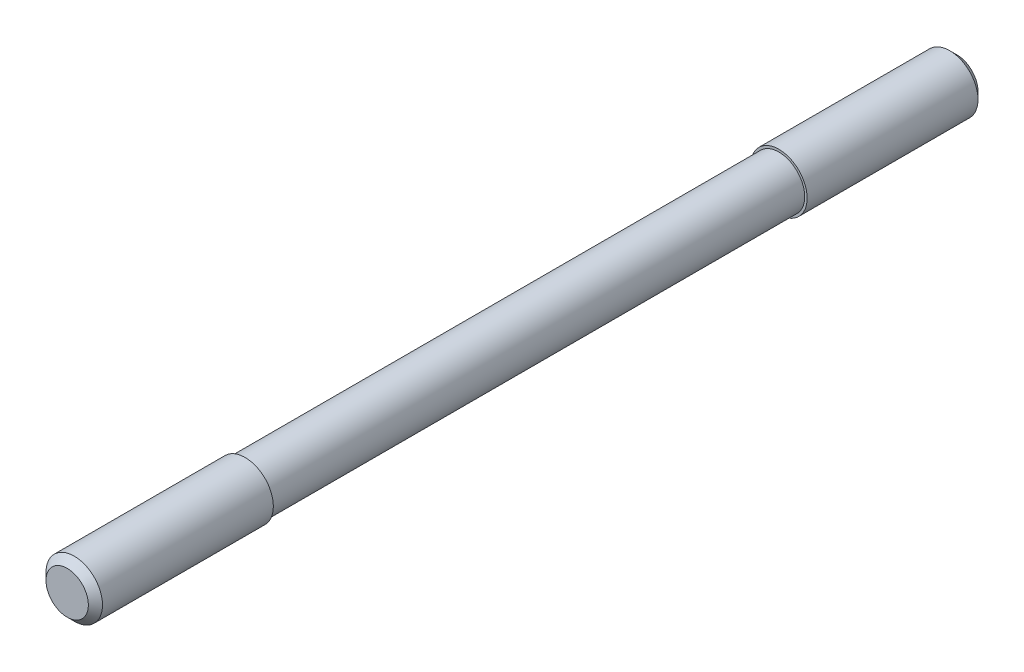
ISO-10303-21;
HEADER;
FILE_DESCRIPTION(('STEP AP214'),'2;1');
FILE_NAME('part.step','',(''),(''),'','','');
FILE_SCHEMA(('AUTOMOTIVE_DESIGN { 1 0 10303 214 1 1 1 1 }'));
ENDSEC;
DATA;
#1=APPLICATION_CONTEXT('core data for automotive mechanical design processes');
#2=APPLICATION_PROTOCOL_DEFINITION('international standard','automotive_design',2000,#1);
#3=PRODUCT_CONTEXT('',#1,'mechanical');
#4=PRODUCT('Part','Part','',(#3));
#5=PRODUCT_RELATED_PRODUCT_CATEGORY('part','',(#4));
#6=PRODUCT_DEFINITION_FORMATION('','',#4);
#7=PRODUCT_DEFINITION_CONTEXT('part definition',#1,'design');
#8=PRODUCT_DEFINITION('design','',#6,#7);
#9=PRODUCT_DEFINITION_SHAPE('','',#8);
#10=(LENGTH_UNIT() NAMED_UNIT(*) SI_UNIT(.MILLI.,.METRE.));
#11=(NAMED_UNIT(*) PLANE_ANGLE_UNIT() SI_UNIT($,.RADIAN.));
#12=(NAMED_UNIT(*) SI_UNIT($,.STERADIAN.) SOLID_ANGLE_UNIT());
#13=UNCERTAINTY_MEASURE_WITH_UNIT(LENGTH_MEASURE(1.E-05),#10,'distance_accuracy_value','');
#14=(GEOMETRIC_REPRESENTATION_CONTEXT(3) GLOBAL_UNCERTAINTY_ASSIGNED_CONTEXT((#13)) GLOBAL_UNIT_ASSIGNED_CONTEXT((#10,
#11,#12)) REPRESENTATION_CONTEXT('',''));
#15=CARTESIAN_POINT('',(0.,0.,0.));
#16=DIRECTION('',(0.,0.,1.));
#17=DIRECTION('',(1.,0.,0.));
#18=AXIS2_PLACEMENT_3D('',#15,#16,#17);
#19=CARTESIAN_POINT('',(0.,0.,0.));
#20=DIRECTION('',(0.,0.,1.));
#21=DIRECTION('',(1.,0.,0.));
#22=AXIS2_PLACEMENT_3D('',#19,#20,#21);
#23=PLANE('',#22);
#24=CARTESIAN_POINT('',(0.,0.,0.));
#25=DIRECTION('',(0.,0.,1.));
#26=DIRECTION('',(1.,0.,0.));
#27=AXIS2_PLACEMENT_3D('',#24,#25,#26);
#28=CIRCLE('',#27,7.5);
#29=CARTESIAN_POINT('',(7.5,0.,0.));
#30=VERTEX_POINT('',#29);
#31=EDGE_CURVE('E8',#30,#30,#28,.T.);
#32=ORIENTED_EDGE('',*,*,#31,.F.);
#33=EDGE_LOOP('',(#32));
#34=FACE_BOUND('',#33,.T.);
#35=ADVANCED_FACE('F12',(#34),#23,.F.);
#36=CARTESIAN_POINT('',(0.,0.,2.5));
#37=DIRECTION('',(0.,0.,1.));
#38=DIRECTION('',(1.,0.,0.));
#39=AXIS2_PLACEMENT_3D('',#36,#37,#38);
#40=CONICAL_SURFACE('',#39,10.,0.785398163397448);
#41=ORIENTED_EDGE('',*,*,#31,.T.);
#42=EDGE_LOOP('',(#41));
#43=FACE_BOUND('',#42,.T.);
#44=CARTESIAN_POINT('',(0.,0.,2.5));
#45=DIRECTION('',(0.,0.,1.));
#46=DIRECTION('',(1.,0.,0.));
#47=AXIS2_PLACEMENT_3D('',#44,#45,#46);
#48=CIRCLE('',#47,10.);
#49=CARTESIAN_POINT('',(10.,0.,2.5));
#50=VERTEX_POINT('',#49);
#51=EDGE_CURVE('E18',#50,#50,#48,.T.);
#52=ORIENTED_EDGE('',*,*,#51,.F.);
#53=EDGE_LOOP('',(#52));
#54=FACE_BOUND('',#53,.T.);
#55=ADVANCED_FACE('F61',(#43,#54),#40,.T.);
#56=CARTESIAN_POINT('',(0.,0.,70.));
#57=DIRECTION('',(0.,0.,1.));
#58=DIRECTION('',(1.,0.,0.));
#59=AXIS2_PLACEMENT_3D('',#56,#57,#58);
#60=CYLINDRICAL_SURFACE('',#59,10.);
#61=CARTESIAN_POINT('',(0.,0.,63.));
#62=DIRECTION('',(0.,0.,1.));
#63=DIRECTION('',(1.,0.,0.));
#64=AXIS2_PLACEMENT_3D('',#61,#62,#63);
#65=CIRCLE('',#64,10.);
#66=CARTESIAN_POINT('',(10.,0.,63.));
#67=VERTEX_POINT('',#66);
#68=EDGE_CURVE('E22',#67,#67,#65,.T.);
#69=ORIENTED_EDGE('',*,*,#68,.F.);
#70=EDGE_LOOP('',(#69));
#71=FACE_BOUND('',#70,.T.);
#72=ORIENTED_EDGE('',*,*,#51,.T.);
#73=EDGE_LOOP('',(#72));
#74=FACE_BOUND('',#73,.T.);
#75=ADVANCED_FACE('F66',(#71,#74),#60,.T.);
#76=CARTESIAN_POINT('',(10.,0.,63.));
#77=DIRECTION('',(0.,0.,-1.));
#78=DIRECTION('',(-1.,0.,0.));
#79=AXIS2_PLACEMENT_3D('',#76,#77,#78);
#80=PLANE('',#79);
#81=CARTESIAN_POINT('',(0.,0.,63.));
#82=DIRECTION('',(0.,0.,1.));
#83=DIRECTION('',(1.,0.,0.));
#84=AXIS2_PLACEMENT_3D('',#81,#82,#83);
#85=CIRCLE('',#84,9.15);
#86=CARTESIAN_POINT('',(9.15,0.,63.));
#87=VERTEX_POINT('',#86);
#88=EDGE_CURVE('E26',#87,#87,#85,.T.);
#89=ORIENTED_EDGE('',*,*,#88,.F.);
#90=EDGE_LOOP('',(#89));
#91=FACE_BOUND('',#90,.T.);
#92=ORIENTED_EDGE('',*,*,#68,.T.);
#93=EDGE_LOOP('',(#92));
#94=FACE_BOUND('',#93,.T.);
#95=ADVANCED_FACE('F70',(#91,#94),#80,.F.);
#96=CARTESIAN_POINT('',(0.,0.,70.));
#97=DIRECTION('',(0.,0.,1.));
#98=DIRECTION('',(1.,0.,0.));
#99=AXIS2_PLACEMENT_3D('',#96,#97,#98);
#100=CYLINDRICAL_SURFACE('',#99,9.15);
#101=CARTESIAN_POINT('',(0.,0.,252.));
#102=DIRECTION('',(0.,0.,1.));
#103=DIRECTION('',(1.,0.,0.));
#104=AXIS2_PLACEMENT_3D('',#101,#102,#103);
#105=CIRCLE('',#104,9.15);
#106=CARTESIAN_POINT('',(9.15,0.,252.));
#107=VERTEX_POINT('',#106);
#108=EDGE_CURVE('E31',#107,#107,#105,.T.);
#109=ORIENTED_EDGE('',*,*,#108,.F.);
#110=EDGE_LOOP('',(#109));
#111=FACE_BOUND('',#110,.T.);
#112=ORIENTED_EDGE('',*,*,#88,.T.);
#113=EDGE_LOOP('',(#112));
#114=FACE_BOUND('',#113,.T.);
#115=ADVANCED_FACE('F77',(#111,#114),#100,.T.);
#116=CARTESIAN_POINT('',(9.15,0.,252.));
#117=DIRECTION('',(0.,0.,1.));
#118=DIRECTION('',(1.,0.,0.));
#119=AXIS2_PLACEMENT_3D('',#116,#117,#118);
#120=PLANE('',#119);
#121=CARTESIAN_POINT('',(0.,0.,252.));
#122=DIRECTION('',(0.,0.,1.));
#123=DIRECTION('',(1.,0.,0.));
#124=AXIS2_PLACEMENT_3D('',#121,#122,#123);
#125=CIRCLE('',#124,10.);
#126=CARTESIAN_POINT('',(10.,0.,252.));
#127=VERTEX_POINT('',#126);
#128=EDGE_CURVE('E34',#127,#127,#125,.T.);
#129=ORIENTED_EDGE('',*,*,#128,.F.);
#130=EDGE_LOOP('',(#129));
#131=FACE_BOUND('',#130,.T.);
#132=ORIENTED_EDGE('',*,*,#108,.T.);
#133=EDGE_LOOP('',(#132));
#134=FACE_BOUND('',#133,.T.);
#135=ADVANCED_FACE('F57',(#131,#134),#120,.F.);
#136=CARTESIAN_POINT('',(0.,0.,70.));
#137=DIRECTION('',(0.,0.,1.));
#138=DIRECTION('',(1.,0.,0.));
#139=AXIS2_PLACEMENT_3D('',#136,#137,#138);
#140=CYLINDRICAL_SURFACE('',#139,10.);
#141=CARTESIAN_POINT('',(0.,0.,312.5));
#142=DIRECTION('',(0.,0.,1.));
#143=DIRECTION('',(1.,0.,0.));
#144=AXIS2_PLACEMENT_3D('',#141,#142,#143);
#145=CIRCLE('',#144,10.);
#146=CARTESIAN_POINT('',(10.,0.,312.5));
#147=VERTEX_POINT('',#146);
#148=EDGE_CURVE('E37',#147,#147,#145,.T.);
#149=ORIENTED_EDGE('',*,*,#148,.F.);
#150=EDGE_LOOP('',(#149));
#151=FACE_BOUND('',#150,.T.);
#152=ORIENTED_EDGE('',*,*,#128,.T.);
#153=EDGE_LOOP('',(#152));
#154=FACE_BOUND('',#153,.T.);
#155=ADVANCED_FACE('F48',(#151,#154),#140,.T.);
#156=CARTESIAN_POINT('',(0.,0.,315.));
#157=DIRECTION('',(0.,0.,-1.));
#158=DIRECTION('',(-1.,0.,0.));
#159=AXIS2_PLACEMENT_3D('',#156,#157,#158);
#160=CONICAL_SURFACE('',#159,7.5,0.785398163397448);
#161=ORIENTED_EDGE('',*,*,#148,.T.);
#162=EDGE_LOOP('',(#161));
#163=FACE_BOUND('',#162,.T.);
#164=CARTESIAN_POINT('',(0.,0.,315.));
#165=DIRECTION('',(0.,0.,1.));
#166=DIRECTION('',(1.,0.,0.));
#167=AXIS2_PLACEMENT_3D('',#164,#165,#166);
#168=CIRCLE('',#167,7.5);
#169=CARTESIAN_POINT('',(7.5,0.,315.));
#170=VERTEX_POINT('',#169);
#171=EDGE_CURVE('E40',#170,#170,#168,.T.);
#172=ORIENTED_EDGE('',*,*,#171,.F.);
#173=EDGE_LOOP('',(#172));
#174=FACE_BOUND('',#173,.T.);
#175=ADVANCED_FACE('F46',(#163,#174),#160,.T.);
#176=CARTESIAN_POINT('',(7.5,0.,315.));
#177=DIRECTION('',(0.,0.,-1.));
#178=DIRECTION('',(-1.,0.,0.));
#179=AXIS2_PLACEMENT_3D('',#176,#177,#178);
#180=PLANE('',#179);
#181=ORIENTED_EDGE('',*,*,#171,.T.);
#182=EDGE_LOOP('',(#181));
#183=FACE_BOUND('',#182,.T.);
#184=ADVANCED_FACE('F44',(#183),#180,.F.);
#185=CLOSED_SHELL('',(#35,#55,#75,#95,#115,#135,#155,#175,#184));
#186=MANIFOLD_SOLID_BREP('B1',#185);
#187=ADVANCED_BREP_SHAPE_REPRESENTATION('',(#18,#186),#14);
#188=SHAPE_DEFINITION_REPRESENTATION(#9,#187);
ENDSEC;
END-ISO-10303-21;
